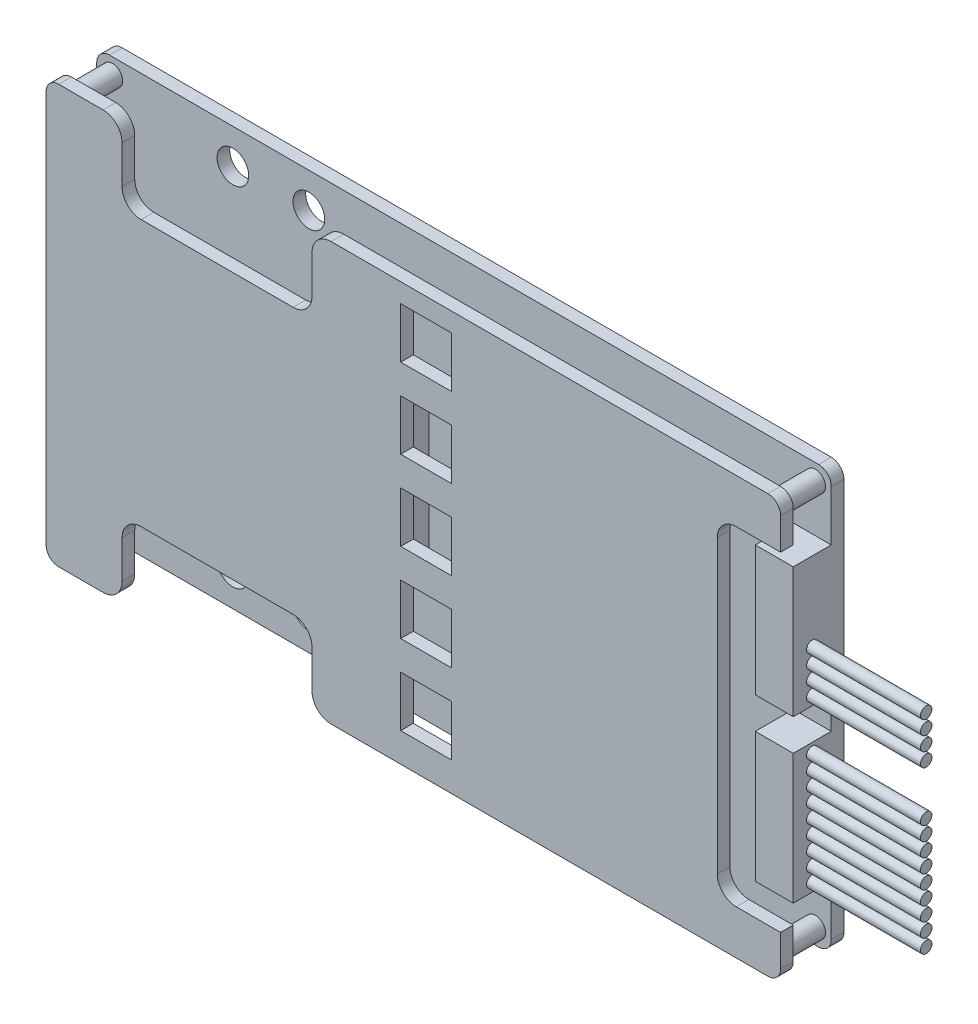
from build123d import *

# Parameters (mm, degrees)
ESQUISSE1_W                = 116
ESQUISSE1_H                = 66
BOSS_EXTRU_1_DEPTH         = 2
CONG_1_R                   = 2
ESQUISSE3_R                = 1.6
ESQUISSE3_W                = 6
ESQUISSE3_H                = 20.5
ESQUISSE3_W_2              = 50
ESQUISSE3_H_2              = 23
BOSS_EXTRU_2_DEPTH         = 6
BOSS_EXTRU_3_START         = 2
ESQUISSE4_W                = 8
ESQUISSE4_H                = 8
BOSS_EXTRU_3_DEPTH         = 2
CONG_2_R                   = 3
ESQUISSE5_R                = 2.5
ENL_V_MAT_EXTRU_1_DEPTH    = 68.208630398
ESQUISSE6_R                = 0.9
BOSS_EXTRU_4_DEPTH         = 18
R_P_TITION_LIN_AIRE3_COUNT = 9
R_P_TITION_LIN_AIRE3_PITCH = 2.2
ESQUISSE7_W                = 8
ESQUISSE7_H                = 11.1
ENL_V_MAT_EXTRU_2_DEPTH    = 122.016527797


with BuildPart() as part:
    # Esquisse1 → Boss.-Extru.1 (new body)
    with BuildSketch(Plane.XY):
        Rectangle(ESQUISSE1_W, ESQUISSE1_H)
    extrude(amount=BOSS_EXTRU_1_DEPTH)

    # Cong_1
    cong_1_edges = [part.edges().sort_by_distance(p)[0] for p in [
        (-58, 33, 1),
        (58, 33, 1),
        (58, -33, 1),
        (-58, -33, 1),
    ]]
    fillet(cong_1_edges, radius=CONG_1_R)

    # Esquisse3 → Boss.-Extru.2 (add)
    with BuildSketch(Plane.XY.offset(2)):
        with Locations((-55.5, 30.5)):
            Circle(ESQUISSE3_R)
        with Locations((55.5, 30.5)):
            Circle(ESQUISSE3_R)
        with Locations((55.5, -30.5)):
            Circle(ESQUISSE3_R)
        with Locations((-55.5, -30.5)):
            Circle(ESQUISSE3_R)
        with Locations((55, 12.75)):
            Rectangle(ESQUISSE3_W, ESQUISSE3_H)
        with Locations((55, -12.75)):
            Rectangle(ESQUISSE3_W, ESQUISSE3_H)
        with Locations((-30.5, 0)):
            Rectangle(ESQUISSE3_W_2, ESQUISSE3_H_2)
    extrude(amount=BOSS_EXTRU_2_DEPTH)

    # Esquisse4 → Boss.-Extru.3 (add)
    with BuildSketch(Plane.XY.offset(8).offset(BOSS_EXTRU_3_START)):
        with BuildLine():
            Line((58, 26), (48, 26))
            Line((48, 26), (48, -26))
            Line((48, -26), (58, -26))
            Line((58, -26), (58, -31))
            ThreePointArc((58, -31), (57.414213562, -32.414213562), (56, -33))
            Line((56, -33), (-16, -33))
            Line((-16, -33), (-16, -21))
            Line((-16, -21), (-46, -21))
            Line((-46, -21), (-46, -33))
            Line((-46, -33), (-56, -33))
            ThreePointArc((-56, -33), (-57.414213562, -32.414213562), (-58, -31))
            Line((-58, -31), (-58, 31))
            ThreePointArc((-58, 31), (-57.414213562, 32.414213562), (-56, 33))
            Line((-56, 33), (-46, 33))
            Line((-46, 33), (-46, 21))
            Line((-46, 21), (-16, 21))
            Line((-16, 21), (-16, 33))
            Line((-16, 33), (56, 33))
            ThreePointArc((56, 33), (57.414213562, 32.414213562), (58, 31))
            Line((58, 31), (58, 26))
        make_face()
        with Locations((2, 26)):
            Rectangle(ESQUISSE4_W, ESQUISSE4_H, mode=Mode.SUBTRACT)
        with Locations((2, 13.4)):
            Rectangle(ESQUISSE4_W, ESQUISSE4_H, mode=Mode.SUBTRACT)
        with Locations((2, 0.8)):
            Rectangle(ESQUISSE4_W, ESQUISSE4_H, mode=Mode.SUBTRACT)
        with Locations((2, -11.8)):
            Rectangle(ESQUISSE4_W, ESQUISSE4_H, mode=Mode.SUBTRACT)
        with Locations((2, -24.4)):
            Rectangle(ESQUISSE4_W, ESQUISSE4_H, mode=Mode.SUBTRACT)
    extrude(amount=-BOSS_EXTRU_3_DEPTH)

    # Cong_2
    cong_2_edges = [part.edges().sort_by_distance(p)[0] for p in [
        (-16, -33, 9),
        (-16, -21, 9),
        (-46, -21, 9),
        (-46, -33, 9),
        (-46, 33, 9),
        (-46, 21, 9),
        (-16, 21, 9),
        (-16, 33, 9),
        (48, 26, 9),
        (48, -26, 9),
    ]]
    fillet(cong_2_edges, radius=CONG_2_R)

    # Esquisse5 → Enl_v. mat.-Extru.1 (cut, through all)
    with BuildSketch(Plane.XY.offset(2)):
        with Locations((-36.5, 27.5)):
            Circle(ESQUISSE5_R)
        with Locations((-24.5, 27.5)):
            Circle(ESQUISSE5_R)
        with Locations((-36.5, -27.5)):
            Circle(ESQUISSE5_R)
        with Locations((-24.5, -27.5)):
            Circle(ESQUISSE5_R)
    extrude(amount=-ENL_V_MAT_EXTRU_1_DEPTH, mode=Mode.SUBTRACT)

    # Esquisse6 → Boss.-Extru.4 (add)
    with BuildSketch(Plane(origin=(58, 0, 0), x_dir=(0, 0, -1), z_dir=(1, 0, 0))):
        with Locations(Location((-5, -21.5, 0), (0, 0, 270))):
            Circle(ESQUISSE6_R)
        with Locations(Location((-5, 4, 0), (0, 0, 270))):
            Circle(ESQUISSE6_R)
    boss_extru_4 = extrude(amount=BOSS_EXTRU_4_DEPTH)

    # R_p_tition lin_aire3: Boss.-Extru.4 ×9
    with Locations(*[(0, i * R_P_TITION_LIN_AIRE3_PITCH, 0) for i in range(1, R_P_TITION_LIN_AIRE3_COUNT)]):
        add(boss_extru_4)

    # Esquisse7 → Enl_v. mat.-Extru.2 (cut, through all)
    with BuildSketch(Plane(origin=(58, 0, 0), x_dir=(0, 0, -1), z_dir=(1, 0, 0))):
        with Locations((-4, 17.45)):
            Rectangle(ESQUISSE7_W, ESQUISSE7_H)
    extrude(amount=ENL_V_MAT_EXTRU_2_DEPTH, mode=Mode.SUBTRACT)


solid = part.part
